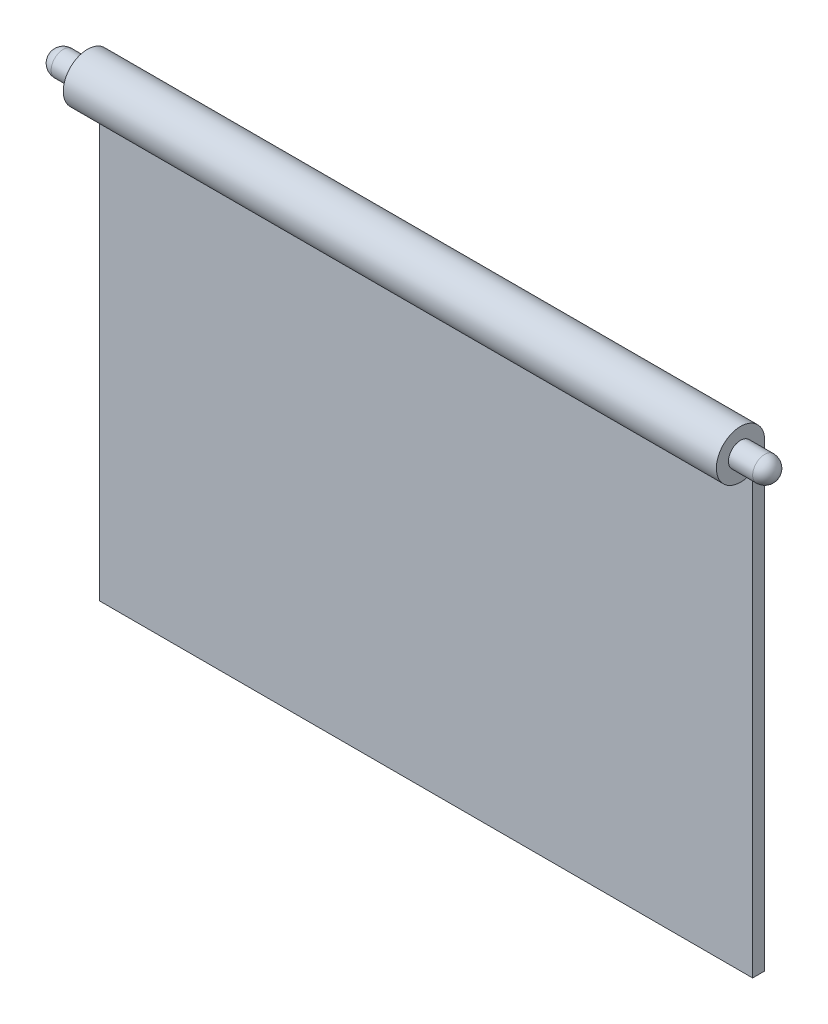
ISO-10303-21;
HEADER;
FILE_DESCRIPTION(('STEP AP214'),'2;1');
FILE_NAME('part.step','',(''),(''),'','','');
FILE_SCHEMA(('AUTOMOTIVE_DESIGN { 1 0 10303 214 1 1 1 1 }'));
ENDSEC;
DATA;
#1=APPLICATION_CONTEXT('core data for automotive mechanical design processes');
#2=APPLICATION_PROTOCOL_DEFINITION('international standard','automotive_design',2000,#1);
#3=PRODUCT_CONTEXT('',#1,'mechanical');
#4=PRODUCT('Part','Part','',(#3));
#5=PRODUCT_RELATED_PRODUCT_CATEGORY('part','',(#4));
#6=PRODUCT_DEFINITION_FORMATION('','',#4);
#7=PRODUCT_DEFINITION_CONTEXT('part definition',#1,'design');
#8=PRODUCT_DEFINITION('design','',#6,#7);
#9=PRODUCT_DEFINITION_SHAPE('','',#8);
#10=(LENGTH_UNIT() NAMED_UNIT(*) SI_UNIT(.MILLI.,.METRE.));
#11=(NAMED_UNIT(*) PLANE_ANGLE_UNIT() SI_UNIT($,.RADIAN.));
#12=(NAMED_UNIT(*) SI_UNIT($,.STERADIAN.) SOLID_ANGLE_UNIT());
#13=UNCERTAINTY_MEASURE_WITH_UNIT(LENGTH_MEASURE(1.E-05),#10,'distance_accuracy_value','');
#14=(GEOMETRIC_REPRESENTATION_CONTEXT(3) GLOBAL_UNCERTAINTY_ASSIGNED_CONTEXT((#13)) GLOBAL_UNIT_ASSIGNED_CONTEXT((#10,
#11,#12)) REPRESENTATION_CONTEXT('',''));
#15=CARTESIAN_POINT('',(0.,0.,0.));
#16=DIRECTION('',(0.,0.,1.));
#17=DIRECTION('',(1.,0.,0.));
#18=AXIS2_PLACEMENT_3D('',#15,#16,#17);
#19=CARTESIAN_POINT('',(135.,-190.,-10.));
#20=DIRECTION('',(0.,0.,1.));
#21=DIRECTION('',(1.,0.,0.));
#22=AXIS2_PLACEMENT_3D('',#19,#20,#21);
#23=PLANE('',#22);
#24=DIRECTION('',(0.,1.,0.));
#25=VECTOR('',#24,1.);
#26=CARTESIAN_POINT('',(-135.,-190.,-10.));
#27=LINE('',#26,#25);
#28=CARTESIAN_POINT('',(-135.,-190.,-10.));
#29=VERTEX_POINT('',#28);
#30=CARTESIAN_POINT('',(-135.,0.,-10.));
#31=VERTEX_POINT('',#30);
#32=EDGE_CURVE('E265',#29,#31,#27,.T.);
#33=ORIENTED_EDGE('',*,*,#32,.T.);
#34=DIRECTION('',(-1.,0.,0.));
#35=VECTOR('',#34,1.);
#36=CARTESIAN_POINT('',(135.,0.,-10.));
#37=LINE('',#36,#35);
#38=CARTESIAN_POINT('',(135.,0.,-10.));
#39=VERTEX_POINT('',#38);
#40=EDGE_CURVE('E280',#39,#31,#37,.T.);
#41=ORIENTED_EDGE('',*,*,#40,.F.);
#42=DIRECTION('',(0.,1.,0.));
#43=VECTOR('',#42,1.);
#44=CARTESIAN_POINT('',(135.,-190.,-10.));
#45=LINE('',#44,#43);
#46=CARTESIAN_POINT('',(135.,-190.,-10.));
#47=VERTEX_POINT('',#46);
#48=EDGE_CURVE('E251',#47,#39,#45,.T.);
#49=ORIENTED_EDGE('',*,*,#48,.F.);
#50=DIRECTION('',(-1.,0.,0.));
#51=VECTOR('',#50,1.);
#52=CARTESIAN_POINT('',(135.,-190.,-10.));
#53=LINE('',#52,#51);
#54=EDGE_CURVE('E284',#47,#29,#53,.T.);
#55=ORIENTED_EDGE('',*,*,#54,.T.);
#56=EDGE_LOOP('',(#33,#41,#49,#55));
#57=FACE_BOUND('',#56,.T.);
#58=DIRECTION('',(-0.707106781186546,-0.707106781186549,0.));
#59=VECTOR('',#58,1.);
#60=CARTESIAN_POINT('',(52.4999999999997,-107.5,-10.));
#61=LINE('',#60,#59);
#62=CARTESIAN_POINT('',(-7.49999999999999,-167.5,-10.));
#63=VERTEX_POINT('',#62);
#64=CARTESIAN_POINT('',(-9.99999999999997,-170.,-10.));
#65=VERTEX_POINT('',#64);
#66=EDGE_CURVE('E296',#63,#65,#61,.T.);
#67=ORIENTED_EDGE('',*,*,#66,.T.);
#68=DIRECTION('',(1.,0.,0.));
#69=VECTOR('',#68,1.);
#70=CARTESIAN_POINT('',(10.,-170.,-10.));
#71=LINE('',#70,#69);
#72=CARTESIAN_POINT('',(10.,-170.,-10.));
#73=VERTEX_POINT('',#72);
#74=EDGE_CURVE('E221',#65,#73,#71,.T.);
#75=ORIENTED_EDGE('',*,*,#74,.T.);
#76=DIRECTION('',(-0.707106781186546,0.70710678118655,0.));
#77=VECTOR('',#76,1.);
#78=CARTESIAN_POINT('',(82.4999999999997,-242.5,-10.));
#79=LINE('',#78,#77);
#80=CARTESIAN_POINT('',(7.5,-167.5,-9.99999999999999));
#81=VERTEX_POINT('',#80);
#82=EDGE_CURVE('E11',#73,#81,#79,.T.);
#83=ORIENTED_EDGE('',*,*,#82,.T.);
#84=DIRECTION('',(-1.,0.,0.));
#85=VECTOR('',#84,1.);
#86=CARTESIAN_POINT('',(135.,-167.5,-10.));
#87=LINE('',#86,#85);
#88=EDGE_CURVE('E54',#81,#63,#87,.T.);
#89=ORIENTED_EDGE('',*,*,#88,.T.);
#90=EDGE_LOOP('',(#67,#75,#83,#89));
#91=FACE_BOUND('',#90,.T.);
#92=DIRECTION('',(-0.707106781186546,0.707106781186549,0.));
#93=VECTOR('',#92,1.);
#94=CARTESIAN_POINT('',(-10.,-20.,-10.));
#95=LINE('',#94,#93);
#96=CARTESIAN_POINT('',(-7.5,-22.5,-10.));
#97=VERTEX_POINT('',#96);
#98=CARTESIAN_POINT('',(-10.,-20.,-10.));
#99=VERTEX_POINT('',#98);
#100=EDGE_CURVE('E61',#97,#99,#95,.T.);
#101=ORIENTED_EDGE('',*,*,#100,.F.);
#102=DIRECTION('',(-1.,0.,0.));
#103=VECTOR('',#102,1.);
#104=CARTESIAN_POINT('',(-7.5,-22.5,-10.));
#105=LINE('',#104,#103);
#106=CARTESIAN_POINT('',(7.5,-22.5,-10.));
#107=VERTEX_POINT('',#106);
#108=EDGE_CURVE('E65',#107,#97,#105,.T.);
#109=ORIENTED_EDGE('',*,*,#108,.F.);
#110=DIRECTION('',(-0.707106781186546,-0.70710678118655,0.));
#111=VECTOR('',#110,1.);
#112=CARTESIAN_POINT('',(7.5,-22.5,-10.));
#113=LINE('',#112,#111);
#114=CARTESIAN_POINT('',(10.,-20.,-10.));
#115=VERTEX_POINT('',#114);
#116=EDGE_CURVE('E183',#115,#107,#113,.T.);
#117=ORIENTED_EDGE('',*,*,#116,.F.);
#118=DIRECTION('',(1.,0.,0.));
#119=VECTOR('',#118,1.);
#120=CARTESIAN_POINT('',(10.,-20.,-10.));
#121=LINE('',#120,#119);
#122=EDGE_CURVE('E178',#99,#115,#121,.T.);
#123=ORIENTED_EDGE('',*,*,#122,.F.);
#124=EDGE_LOOP('',(#101,#109,#117,#123));
#125=FACE_BOUND('',#124,.T.);
#126=ADVANCED_FACE('F45',(#57,#91,#125),#23,.F.);
#127=CARTESIAN_POINT('',(135.,-190.,-5.00000000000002));
#128=DIRECTION('',(0.,1.,0.));
#129=DIRECTION('',(0.,0.,1.));
#130=AXIS2_PLACEMENT_3D('',#127,#128,#129);
#131=PLANE('',#130);
#132=DIRECTION('',(0.,0.,-1.));
#133=VECTOR('',#132,1.);
#134=CARTESIAN_POINT('',(-135.,-190.,-5.00000000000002));
#135=LINE('',#134,#133);
#136=CARTESIAN_POINT('',(-135.,-190.,-5.00000000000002));
#137=VERTEX_POINT('',#136);
#138=EDGE_CURVE('E246',#137,#29,#135,.T.);
#139=ORIENTED_EDGE('',*,*,#138,.T.);
#140=ORIENTED_EDGE('',*,*,#54,.F.);
#141=DIRECTION('',(0.,0.,-1.));
#142=VECTOR('',#141,1.);
#143=CARTESIAN_POINT('',(135.,-190.,-5.00000000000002));
#144=LINE('',#143,#142);
#145=CARTESIAN_POINT('',(135.,-190.,-5.00000000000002));
#146=VERTEX_POINT('',#145);
#147=EDGE_CURVE('E247',#146,#47,#144,.T.);
#148=ORIENTED_EDGE('',*,*,#147,.F.);
#149=DIRECTION('',(-1.,0.,0.));
#150=VECTOR('',#149,1.);
#151=CARTESIAN_POINT('',(135.,-190.,-5.00000000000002));
#152=LINE('',#151,#150);
#153=EDGE_CURVE('E261',#146,#137,#152,.T.);
#154=ORIENTED_EDGE('',*,*,#153,.T.);
#155=EDGE_LOOP('',(#139,#140,#148,#154));
#156=FACE_BOUND('',#155,.T.);
#157=ADVANCED_FACE('F328',(#156),#131,.F.);
#158=CARTESIAN_POINT('',(135.,0.,0.));
#159=DIRECTION('',(-1.,0.,0.));
#160=DIRECTION('',(0.,0.,1.));
#161=AXIS2_PLACEMENT_3D('',#158,#159,#160);
#162=CYLINDRICAL_SURFACE('',#161,10.);
#163=CARTESIAN_POINT('',(-135.,0.,0.));
#164=DIRECTION('',(1.,0.,0.));
#165=DIRECTION('',(0.,0.,-1.));
#166=AXIS2_PLACEMENT_3D('',#163,#164,#165);
#167=CIRCLE('',#166,10.);
#168=CARTESIAN_POINT('',(-135.,-8.66025403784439,-5.));
#169=VERTEX_POINT('',#168);
#170=EDGE_CURVE('E268',#31,#169,#167,.T.);
#171=ORIENTED_EDGE('',*,*,#170,.T.);
#172=DIRECTION('',(-1.,0.,0.));
#173=VECTOR('',#172,1.);
#174=CARTESIAN_POINT('',(135.,-8.66025403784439,-5.));
#175=LINE('',#174,#173);
#176=CARTESIAN_POINT('',(135.,-8.66025403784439,-5.));
#177=VERTEX_POINT('',#176);
#178=EDGE_CURVE('E276',#177,#169,#175,.T.);
#179=ORIENTED_EDGE('',*,*,#178,.F.);
#180=CARTESIAN_POINT('',(135.,0.,0.));
#181=DIRECTION('',(1.,0.,0.));
#182=DIRECTION('',(0.,0.,-1.));
#183=AXIS2_PLACEMENT_3D('',#180,#181,#182);
#184=CIRCLE('',#183,10.);
#185=EDGE_CURVE('E255',#39,#177,#184,.T.);
#186=ORIENTED_EDGE('',*,*,#185,.F.);
#187=ORIENTED_EDGE('',*,*,#40,.T.);
#188=EDGE_LOOP('',(#171,#179,#186,#187));
#189=FACE_BOUND('',#188,.T.);
#190=ADVANCED_FACE('F352',(#189),#162,.T.);
#191=CARTESIAN_POINT('',(135.,-8.66025403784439,-5.));
#192=DIRECTION('',(0.,0.,-1.));
#193=DIRECTION('',(0.,1.,0.));
#194=AXIS2_PLACEMENT_3D('',#191,#192,#193);
#195=PLANE('',#194);
#196=DIRECTION('',(0.,-1.,0.));
#197=VECTOR('',#196,1.);
#198=CARTESIAN_POINT('',(-135.,-8.66025403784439,-5.));
#199=LINE('',#198,#197);
#200=EDGE_CURVE('E252',#169,#137,#199,.T.);
#201=ORIENTED_EDGE('',*,*,#200,.T.);
#202=ORIENTED_EDGE('',*,*,#153,.F.);
#203=DIRECTION('',(0.,-1.,0.));
#204=VECTOR('',#203,1.);
#205=CARTESIAN_POINT('',(135.,-8.66025403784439,-5.));
#206=LINE('',#205,#204);
#207=EDGE_CURVE('E258',#177,#146,#206,.T.);
#208=ORIENTED_EDGE('',*,*,#207,.F.);
#209=ORIENTED_EDGE('',*,*,#178,.T.);
#210=EDGE_LOOP('',(#201,#202,#208,#209));
#211=FACE_BOUND('',#210,.T.);
#212=ADVANCED_FACE('F356',(#211),#195,.F.);
#213=CARTESIAN_POINT('',(135.,0.,0.));
#214=DIRECTION('',(1.,0.,0.));
#215=DIRECTION('',(0.,0.,-1.));
#216=AXIS2_PLACEMENT_3D('',#213,#214,#215);
#217=PLANE('',#216);
#218=CARTESIAN_POINT('',(135.,0.,0.));
#219=DIRECTION('',(1.,0.,0.));
#220=DIRECTION('',(0.,0.,-1.));
#221=AXIS2_PLACEMENT_3D('',#218,#219,#220);
#222=CIRCLE('',#221,5.);
#223=CARTESIAN_POINT('',(135.,0.,-5.));
#224=VERTEX_POINT('',#223);
#225=EDGE_CURVE('E242',#224,#224,#222,.T.);
#226=ORIENTED_EDGE('',*,*,#225,.F.);
#227=EDGE_LOOP('',(#226));
#228=FACE_BOUND('',#227,.T.);
#229=ORIENTED_EDGE('',*,*,#147,.T.);
#230=ORIENTED_EDGE('',*,*,#48,.T.);
#231=ORIENTED_EDGE('',*,*,#185,.T.);
#232=ORIENTED_EDGE('',*,*,#207,.T.);
#233=EDGE_LOOP('',(#229,#230,#231,#232));
#234=FACE_BOUND('',#233,.T.);
#235=ADVANCED_FACE('F342',(#228,#234),#217,.T.);
#236=CARTESIAN_POINT('',(-135.,0.,0.));
#237=DIRECTION('',(1.,0.,0.));
#238=DIRECTION('',(0.,0.,-1.));
#239=AXIS2_PLACEMENT_3D('',#236,#237,#238);
#240=PLANE('',#239);
#241=CARTESIAN_POINT('',(-135.,0.,0.));
#242=DIRECTION('',(1.,0.,0.));
#243=DIRECTION('',(0.,0.,-1.));
#244=AXIS2_PLACEMENT_3D('',#241,#242,#243);
#245=CIRCLE('',#244,5.);
#246=CARTESIAN_POINT('',(-135.,0.,-5.));
#247=VERTEX_POINT('',#246);
#248=EDGE_CURVE('E187',#247,#247,#245,.T.);
#249=ORIENTED_EDGE('',*,*,#248,.T.);
#250=EDGE_LOOP('',(#249));
#251=FACE_BOUND('',#250,.T.);
#252=ORIENTED_EDGE('',*,*,#138,.F.);
#253=ORIENTED_EDGE('',*,*,#200,.F.);
#254=ORIENTED_EDGE('',*,*,#170,.F.);
#255=ORIENTED_EDGE('',*,*,#32,.F.);
#256=EDGE_LOOP('',(#252,#253,#254,#255));
#257=FACE_BOUND('',#256,.T.);
#258=ADVANCED_FACE('F336',(#251,#257),#240,.F.);
#259=CARTESIAN_POINT('',(150.,0.,0.));
#260=DIRECTION('',(-1.,0.,0.));
#261=DIRECTION('',(0.,0.,1.));
#262=AXIS2_PLACEMENT_3D('',#259,#260,#261);
#263=CYLINDRICAL_SURFACE('',#262,5.);
#264=CARTESIAN_POINT('',(145.,0.,0.));
#265=DIRECTION('',(-1.,0.,0.));
#266=DIRECTION('',(0.,0.,1.));
#267=AXIS2_PLACEMENT_3D('',#264,#265,#266);
#268=CIRCLE('',#267,5.);
#269=CARTESIAN_POINT('',(145.,0.,5.));
#270=VERTEX_POINT('',#269);
#271=EDGE_CURVE('E288',#270,#270,#268,.T.);
#272=ORIENTED_EDGE('',*,*,#271,.T.);
#273=EDGE_LOOP('',(#272));
#274=FACE_BOUND('',#273,.T.);
#275=ORIENTED_EDGE('',*,*,#225,.T.);
#276=EDGE_LOOP('',(#275));
#277=FACE_BOUND('',#276,.T.);
#278=ADVANCED_FACE('F341',(#274,#277),#263,.T.);
#279=CARTESIAN_POINT('',(145.,0.,0.));
#280=DIRECTION('',(1.,0.,0.));
#281=DIRECTION('',(0.,0.,-1.));
#282=AXIS2_PLACEMENT_3D('',#279,#280,#281);
#283=SPHERICAL_SURFACE('',#282,5.);
#284=ORIENTED_EDGE('',*,*,#271,.F.);
#285=EDGE_LOOP('',(#284));
#286=FACE_BOUND('',#285,.T.);
#287=ADVANCED_FACE('F383',(#286),#283,.T.);
#288=CARTESIAN_POINT('',(-150.,0.,0.));
#289=DIRECTION('',(1.,0.,0.));
#290=DIRECTION('',(0.,0.,-1.));
#291=AXIS2_PLACEMENT_3D('',#288,#289,#290);
#292=CYLINDRICAL_SURFACE('',#291,5.);
#293=CARTESIAN_POINT('',(-145.,0.,0.));
#294=DIRECTION('',(1.,0.,0.));
#295=DIRECTION('',(0.,0.,-1.));
#296=AXIS2_PLACEMENT_3D('',#293,#294,#295);
#297=CIRCLE('',#296,5.);
#298=CARTESIAN_POINT('',(-145.,0.,-5.));
#299=VERTEX_POINT('',#298);
#300=EDGE_CURVE('E292',#299,#299,#297,.T.);
#301=ORIENTED_EDGE('',*,*,#300,.T.);
#302=EDGE_LOOP('',(#301));
#303=FACE_BOUND('',#302,.T.);
#304=ORIENTED_EDGE('',*,*,#248,.F.);
#305=EDGE_LOOP('',(#304));
#306=FACE_BOUND('',#305,.T.);
#307=ADVANCED_FACE('F392',(#303,#306),#292,.T.);
#308=CARTESIAN_POINT('',(-145.,0.,0.));
#309=DIRECTION('',(-1.,0.,0.));
#310=DIRECTION('',(0.,0.,1.));
#311=AXIS2_PLACEMENT_3D('',#308,#309,#310);
#312=SPHERICAL_SURFACE('',#311,5.);
#313=ORIENTED_EDGE('',*,*,#300,.F.);
#314=EDGE_LOOP('',(#313));
#315=FACE_BOUND('',#314,.T.);
#316=ADVANCED_FACE('F47',(#315),#312,.T.);
#317=CARTESIAN_POINT('',(7.5,-148.816109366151,-38.0258359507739));
#318=DIRECTION('',(0.639602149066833,0.63960214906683,0.42640143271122));
#319=DIRECTION('',(-0.707106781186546,0.70710678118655,0.));
#320=AXIS2_PLACEMENT_3D('',#317,#318,#319);
#321=PLANE('',#320);
#322=ORIENTED_EDGE('',*,*,#82,.F.);
#323=DIRECTION('',(0.,-0.554700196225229,0.832050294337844));
#324=VECTOR('',#323,1.);
#325=CARTESIAN_POINT('',(10.,-149.777647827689,-40.3335282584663));
#326=LINE('',#325,#324);
#327=CARTESIAN_POINT('',(10.,-150.,-40.));
#328=VERTEX_POINT('',#327);
#329=EDGE_CURVE('E209',#328,#73,#326,.T.);
#330=ORIENTED_EDGE('',*,*,#329,.F.);
#331=DIRECTION('',(0.72727761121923,-0.323856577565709,-0.605131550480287));
#332=VECTOR('',#331,1.);
#333=CARTESIAN_POINT('',(-17.9142800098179,-137.569776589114,-16.773915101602));
#334=LINE('',#333,#332);
#335=CARTESIAN_POINT('',(7.5,-148.886750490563,-37.9198742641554));
#336=VERTEX_POINT('',#335);
#337=EDGE_CURVE('E201',#336,#328,#334,.T.);
#338=ORIENTED_EDGE('',*,*,#337,.F.);
#339=DIRECTION('',(0.,-0.554700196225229,0.832050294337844));
#340=VECTOR('',#339,1.);
#341=CARTESIAN_POINT('',(7.5,-148.816109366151,-38.0258359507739));
#342=LINE('',#341,#340);
#343=EDGE_CURVE('E232',#336,#81,#342,.T.);
#344=ORIENTED_EDGE('',*,*,#343,.T.);
#345=EDGE_LOOP('',(#322,#330,#338,#344));
#346=FACE_BOUND('',#345,.T.);
#347=ADVANCED_FACE('F307',(#346),#321,.T.);
#348=CARTESIAN_POINT('',(-7.5,-148.816109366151,-38.0258359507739));
#349=DIRECTION('',(0.,0.832050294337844,0.554700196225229));
#350=DIRECTION('',(0.,-0.554700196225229,0.832050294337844));
#351=AXIS2_PLACEMENT_3D('',#348,#349,#350);
#352=PLANE('',#351);
#353=ORIENTED_EDGE('',*,*,#88,.F.);
#354=ORIENTED_EDGE('',*,*,#343,.F.);
#355=DIRECTION('',(1.,0.,0.));
#356=VECTOR('',#355,1.);
#357=CARTESIAN_POINT('',(-7.49999999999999,-148.886750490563,-37.9198742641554));
#358=LINE('',#357,#356);
#359=CARTESIAN_POINT('',(-7.5,-148.886750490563,-37.9198742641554));
#360=VERTEX_POINT('',#359);
#361=EDGE_CURVE('E208',#360,#336,#358,.T.);
#362=ORIENTED_EDGE('',*,*,#361,.F.);
#363=DIRECTION('',(0.,-0.554700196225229,0.832050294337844));
#364=VECTOR('',#363,1.);
#365=CARTESIAN_POINT('',(-7.5,-148.816109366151,-38.0258359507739));
#366=LINE('',#365,#364);
#367=EDGE_CURVE('E228',#360,#63,#366,.T.);
#368=ORIENTED_EDGE('',*,*,#367,.T.);
#369=EDGE_LOOP('',(#353,#354,#362,#368));
#370=FACE_BOUND('',#369,.T.);
#371=ADVANCED_FACE('F304',(#370),#352,.T.);
#372=CARTESIAN_POINT('',(-10.,-149.777647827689,-40.3335282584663));
#373=DIRECTION('',(-0.639602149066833,0.63960214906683,0.42640143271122));
#374=DIRECTION('',(-0.707106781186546,-0.707106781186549,0.));
#375=AXIS2_PLACEMENT_3D('',#372,#373,#374);
#376=PLANE('',#375);
#377=ORIENTED_EDGE('',*,*,#66,.F.);
#378=ORIENTED_EDGE('',*,*,#367,.F.);
#379=DIRECTION('',(0.72727761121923,0.323856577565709,0.605131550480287));
#380=VECTOR('',#379,1.);
#381=CARTESIAN_POINT('',(16.0031141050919,-138.42081839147,-18.3641012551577));
#382=LINE('',#381,#380);
#383=CARTESIAN_POINT('',(-10.,-150.,-40.));
#384=VERTEX_POINT('',#383);
#385=EDGE_CURVE('E205',#384,#360,#382,.T.);
#386=ORIENTED_EDGE('',*,*,#385,.F.);
#387=DIRECTION('',(0.,-0.554700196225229,0.832050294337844));
#388=VECTOR('',#387,1.);
#389=CARTESIAN_POINT('',(-10.,-149.777647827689,-40.3335282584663));
#390=LINE('',#389,#388);
#391=EDGE_CURVE('E225',#384,#65,#390,.T.);
#392=ORIENTED_EDGE('',*,*,#391,.T.);
#393=EDGE_LOOP('',(#377,#378,#386,#392));
#394=FACE_BOUND('',#393,.T.);
#395=ADVANCED_FACE('F417',(#394),#376,.T.);
#396=CARTESIAN_POINT('',(10.,-149.777647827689,-40.3335282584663));
#397=DIRECTION('',(0.,-0.832050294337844,-0.554700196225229));
#398=DIRECTION('',(0.,0.554700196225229,-0.832050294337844));
#399=AXIS2_PLACEMENT_3D('',#396,#397,#398);
#400=PLANE('',#399);
#401=DIRECTION('',(1.,0.,0.));
#402=VECTOR('',#401,1.);
#403=CARTESIAN_POINT('',(10.,-150.,-40.));
#404=LINE('',#403,#402);
#405=EDGE_CURVE('E147',#384,#328,#404,.T.);
#406=ORIENTED_EDGE('',*,*,#405,.T.);
#407=ORIENTED_EDGE('',*,*,#329,.T.);
#408=ORIENTED_EDGE('',*,*,#74,.F.);
#409=ORIENTED_EDGE('',*,*,#391,.F.);
#410=EDGE_LOOP('',(#406,#407,#408,#409));
#411=FACE_BOUND('',#410,.T.);
#412=ADVANCED_FACE('F424',(#411),#400,.T.);
#413=CARTESIAN_POINT('',(10.,-39.5991489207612,-40.));
#414=DIRECTION('',(0.,0.,-1.));
#415=DIRECTION('',(-1.,0.,0.));
#416=AXIS2_PLACEMENT_3D('',#413,#414,#415);
#417=PLANE('',#416);
#418=DIRECTION('',(1.,0.,0.));
#419=VECTOR('',#418,1.);
#420=CARTESIAN_POINT('',(10.,-40.,-40.));
#421=LINE('',#420,#419);
#422=CARTESIAN_POINT('',(-10.,-40.,-40.));
#423=VERTEX_POINT('',#422);
#424=CARTESIAN_POINT('',(10.,-40.,-40.));
#425=VERTEX_POINT('',#424);
#426=EDGE_CURVE('E154',#423,#425,#421,.T.);
#427=ORIENTED_EDGE('',*,*,#426,.T.);
#428=DIRECTION('',(0.,-1.,0.));
#429=VECTOR('',#428,1.);
#430=CARTESIAN_POINT('',(10.,-39.5991489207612,-40.));
#431=LINE('',#430,#429);
#432=EDGE_CURVE('E198',#425,#328,#431,.T.);
#433=ORIENTED_EDGE('',*,*,#432,.T.);
#434=ORIENTED_EDGE('',*,*,#405,.F.);
#435=DIRECTION('',(0.,-1.,0.));
#436=VECTOR('',#435,1.);
#437=CARTESIAN_POINT('',(-10.,-39.5991489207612,-40.));
#438=LINE('',#437,#436);
#439=EDGE_CURVE('E138',#423,#384,#438,.T.);
#440=ORIENTED_EDGE('',*,*,#439,.F.);
#441=EDGE_LOOP('',(#427,#433,#434,#440));
#442=FACE_BOUND('',#441,.T.);
#443=ADVANCED_FACE('F152',(#442),#417,.T.);
#444=CARTESIAN_POINT('',(7.5,-40.9858994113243,-37.9198742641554));
#445=DIRECTION('',(0.639602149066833,0.,0.768706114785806));
#446=DIRECTION('',(0.768706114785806,0.,-0.639602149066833));
#447=AXIS2_PLACEMENT_3D('',#444,#445,#446);
#448=PLANE('',#447);
#449=DIRECTION('',(0.,-1.,0.));
#450=VECTOR('',#449,1.);
#451=CARTESIAN_POINT('',(7.5,-40.9858994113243,-37.9198742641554));
#452=LINE('',#451,#450);
#453=CARTESIAN_POINT('',(7.5,-41.1132495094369,-37.9198742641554));
#454=VERTEX_POINT('',#453);
#455=EDGE_CURVE('E200',#454,#336,#452,.T.);
#456=ORIENTED_EDGE('',*,*,#455,.T.);
#457=ORIENTED_EDGE('',*,*,#337,.T.);
#458=ORIENTED_EDGE('',*,*,#432,.F.);
#459=DIRECTION('',(0.72727761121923,0.323856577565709,-0.605131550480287));
#460=VECTOR('',#459,1.);
#461=CARTESIAN_POINT('',(-0.403451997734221,-44.6326551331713,-31.3438047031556));
#462=LINE('',#461,#460);
#463=EDGE_CURVE('E167',#454,#425,#462,.T.);
#464=ORIENTED_EDGE('',*,*,#463,.F.);
#465=EDGE_LOOP('',(#456,#457,#458,#464));
#466=FACE_BOUND('',#465,.T.);
#467=ADVANCED_FACE('F310',(#466),#448,.T.);
#468=CARTESIAN_POINT('',(-7.5,-40.9858994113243,-37.9198742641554));
#469=DIRECTION('',(0.,0.,1.));
#470=DIRECTION('',(1.,0.,0.));
#471=AXIS2_PLACEMENT_3D('',#468,#469,#470);
#472=PLANE('',#471);
#473=DIRECTION('',(0.,-1.,0.));
#474=VECTOR('',#473,1.);
#475=CARTESIAN_POINT('',(-7.5,-40.9858994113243,-37.9198742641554));
#476=LINE('',#475,#474);
#477=CARTESIAN_POINT('',(-7.5,-41.1132495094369,-37.9198742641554));
#478=VERTEX_POINT('',#477);
#479=EDGE_CURVE('E140',#478,#360,#476,.T.);
#480=ORIENTED_EDGE('',*,*,#479,.T.);
#481=ORIENTED_EDGE('',*,*,#361,.T.);
#482=ORIENTED_EDGE('',*,*,#455,.F.);
#483=DIRECTION('',(1.,0.,0.));
#484=VECTOR('',#483,1.);
#485=CARTESIAN_POINT('',(-7.49999999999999,-41.1132495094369,-37.9198742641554));
#486=LINE('',#485,#484);
#487=EDGE_CURVE('E146',#478,#454,#486,.T.);
#488=ORIENTED_EDGE('',*,*,#487,.F.);
#489=EDGE_LOOP('',(#480,#481,#482,#488));
#490=FACE_BOUND('',#489,.T.);
#491=ADVANCED_FACE('F313',(#490),#472,.T.);
#492=CARTESIAN_POINT('',(-10.,-39.5991489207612,-40.));
#493=DIRECTION('',(-0.639602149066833,0.,0.768706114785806));
#494=DIRECTION('',(0.768706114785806,0.,0.639602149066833));
#495=AXIS2_PLACEMENT_3D('',#492,#493,#494);
#496=PLANE('',#495);
#497=ORIENTED_EDGE('',*,*,#439,.T.);
#498=ORIENTED_EDGE('',*,*,#385,.T.);
#499=ORIENTED_EDGE('',*,*,#479,.F.);
#500=DIRECTION('',(0.72727761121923,-0.323856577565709,0.605131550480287));
#501=VECTOR('',#500,1.);
#502=CARTESIAN_POINT('',(-1.50771390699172,-43.7816133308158,-32.9339908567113));
#503=LINE('',#502,#501);
#504=EDGE_CURVE('E134',#423,#478,#503,.T.);
#505=ORIENTED_EDGE('',*,*,#504,.F.);
#506=EDGE_LOOP('',(#497,#498,#499,#505));
#507=FACE_BOUND('',#506,.T.);
#508=ADVANCED_FACE('F136',(#507),#496,.T.);
#509=CARTESIAN_POINT('',(10.,-20.,-10.));
#510=DIRECTION('',(0.,0.832050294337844,-0.554700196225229));
#511=DIRECTION('',(0.,0.554700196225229,0.832050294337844));
#512=AXIS2_PLACEMENT_3D('',#509,#510,#511);
#513=PLANE('',#512);
#514=ORIENTED_EDGE('',*,*,#426,.F.);
#515=DIRECTION('',(0.,-0.554700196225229,-0.832050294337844));
#516=VECTOR('',#515,1.);
#517=CARTESIAN_POINT('',(-10.,-20.,-10.));
#518=LINE('',#517,#516);
#519=EDGE_CURVE('E163',#99,#423,#518,.T.);
#520=ORIENTED_EDGE('',*,*,#519,.F.);
#521=ORIENTED_EDGE('',*,*,#122,.T.);
#522=DIRECTION('',(0.,-0.554700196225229,-0.832050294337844));
#523=VECTOR('',#522,1.);
#524=CARTESIAN_POINT('',(10.,-20.,-10.));
#525=LINE('',#524,#523);
#526=EDGE_CURVE('E165',#115,#425,#525,.T.);
#527=ORIENTED_EDGE('',*,*,#526,.T.);
#528=EDGE_LOOP('',(#514,#520,#521,#527));
#529=FACE_BOUND('',#528,.T.);
#530=ADVANCED_FACE('F161',(#529),#513,.T.);
#531=CARTESIAN_POINT('',(7.5,-22.5,-10.));
#532=DIRECTION('',(0.639602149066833,-0.63960214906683,0.42640143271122));
#533=DIRECTION('',(0.707106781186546,0.70710678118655,0.));
#534=AXIS2_PLACEMENT_3D('',#531,#532,#533);
#535=PLANE('',#534);
#536=DIRECTION('',(0.,-0.554700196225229,-0.832050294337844));
#537=VECTOR('',#536,1.);
#538=CARTESIAN_POINT('',(7.5,-22.5,-10.));
#539=LINE('',#538,#537);
#540=EDGE_CURVE('E174',#107,#454,#539,.T.);
#541=ORIENTED_EDGE('',*,*,#540,.T.);
#542=ORIENTED_EDGE('',*,*,#463,.T.);
#543=ORIENTED_EDGE('',*,*,#526,.F.);
#544=ORIENTED_EDGE('',*,*,#116,.T.);
#545=EDGE_LOOP('',(#541,#542,#543,#544));
#546=FACE_BOUND('',#545,.T.);
#547=ADVANCED_FACE('F318',(#546),#535,.T.);
#548=CARTESIAN_POINT('',(-7.5,-22.5,-10.));
#549=DIRECTION('',(0.,-0.832050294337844,0.554700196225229));
#550=DIRECTION('',(0.,-0.554700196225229,-0.832050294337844));
#551=AXIS2_PLACEMENT_3D('',#548,#549,#550);
#552=PLANE('',#551);
#553=DIRECTION('',(0.,-0.554700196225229,-0.832050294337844));
#554=VECTOR('',#553,1.);
#555=CARTESIAN_POINT('',(-7.5,-22.5,-10.));
#556=LINE('',#555,#554);
#557=EDGE_CURVE('E171',#97,#478,#556,.T.);
#558=ORIENTED_EDGE('',*,*,#557,.T.);
#559=ORIENTED_EDGE('',*,*,#487,.T.);
#560=ORIENTED_EDGE('',*,*,#540,.F.);
#561=ORIENTED_EDGE('',*,*,#108,.T.);
#562=EDGE_LOOP('',(#558,#559,#560,#561));
#563=FACE_BOUND('',#562,.T.);
#564=ADVANCED_FACE('F316',(#563),#552,.T.);
#565=CARTESIAN_POINT('',(-10.,-20.,-10.));
#566=DIRECTION('',(-0.639602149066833,-0.63960214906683,0.42640143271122));
#567=DIRECTION('',(0.707106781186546,-0.707106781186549,0.));
#568=AXIS2_PLACEMENT_3D('',#565,#566,#567);
#569=PLANE('',#568);
#570=ORIENTED_EDGE('',*,*,#519,.T.);
#571=ORIENTED_EDGE('',*,*,#504,.T.);
#572=ORIENTED_EDGE('',*,*,#557,.F.);
#573=ORIENTED_EDGE('',*,*,#100,.T.);
#574=EDGE_LOOP('',(#570,#571,#572,#573));
#575=FACE_BOUND('',#574,.T.);
#576=ADVANCED_FACE('F169',(#575),#569,.T.);
#577=CLOSED_SHELL('',(#126,#157,#190,#212,#235,#258,#278,#287,#307,#316,#347,#371,#395,#412,
#443,#467,#491,#508,#530,#547,#564,#576));
#578=MANIFOLD_SOLID_BREP('B2',#577);
#579=ADVANCED_BREP_SHAPE_REPRESENTATION('',(#18,#578),#14);
#580=SHAPE_DEFINITION_REPRESENTATION(#9,#579);
ENDSEC;
END-ISO-10303-21;
